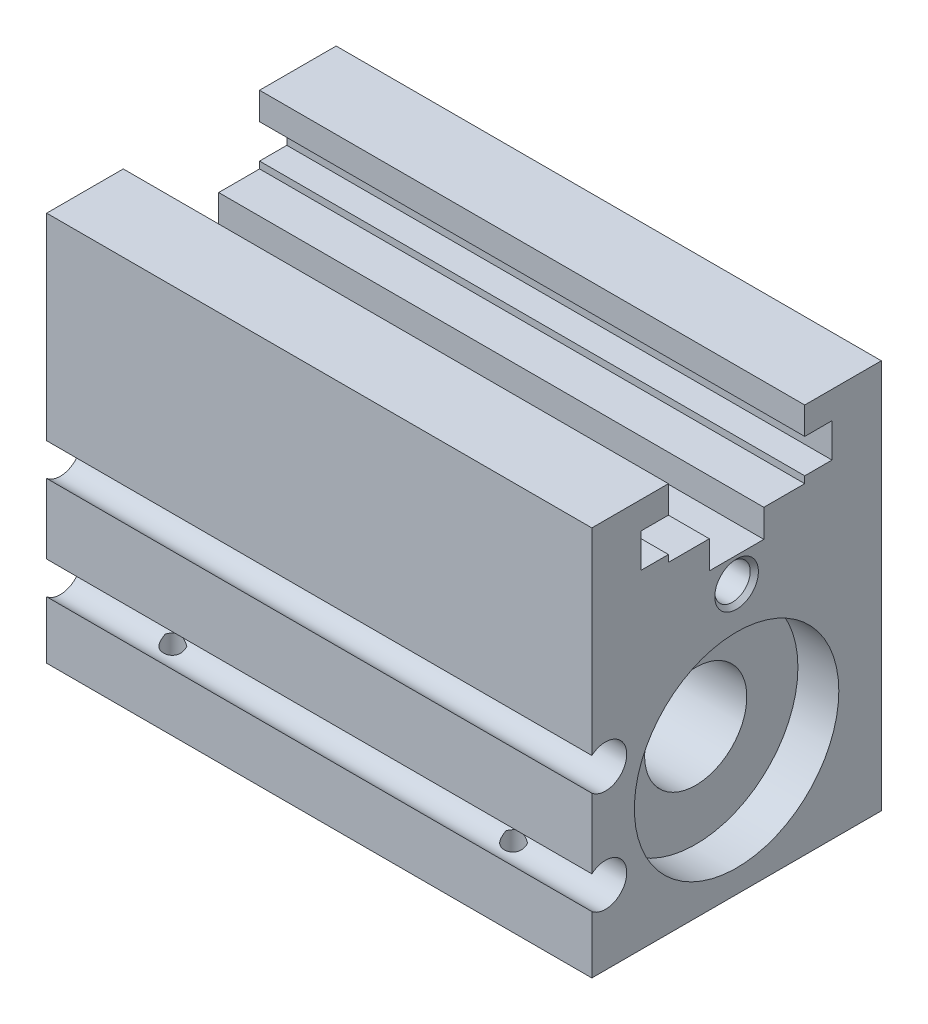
from build123d import *

# Parameters (mm, degrees)
EXTRUDE1_DEPTH     = 50.8
SKETCH2_R          = 9.525
CUT_EXTRUDE1_DEPTH = 3.81
SKETCH3_R          = 1.20269
CUT_EXTRUDE2_DEPTH = 3.048
SKETCH4_R          = 1.20269
CUT_EXTRUDE3_DEPTH = 3.048
CUT_EXTRUDE4_START = 3.81
SKETCH9_R          = 9.525
CUT_EXTRUDE4_DEPTH = 3.81
SKETCH10_W         = 3.81
SKETCH10_H         = 9.3345
SKETCH15_R         = 1.20269
CUT_EXTRUDE5_DEPTH = 3.175
SKETCH16_R         = 1.20269
CUT_EXTRUDE6_DEPTH = 3.175
SKETCH17_R         = 1.20269
CUT_EXTRUDE7_DEPTH = 3.175
SKETCH18_R         = 1.20269
CUT_EXTRUDE8_DEPTH = 3.175
SKETCH20_W         = 40.64
SKETCH20_H         = 4.7625


with BuildPart() as part:
    # Sketch1 → Extrude1 (new body)
    with BuildSketch(Plane(origin=(0, 0, 0), x_dir=(0, 0, -1), z_dir=(1, 0, 0))):
        with BuildLine():
            Line((-13.4874, -18.161), (13.4874, -18.161))
            Line((13.4874, -18.161), (13.4874, 18.161))
            Line((13.4874, 18.161), (6.35, 18.161))
            Line((6.35, 18.161), (6.35, 15.621))
            Line((6.35, 15.621), (8.89, 15.621))
            Line((8.89, 15.621), (8.89, 12.446))
            Line((8.89, 12.446), (6.35, 12.446))
            Line((6.35, 12.446), (6.35, 11.811))
            Line((6.35, 11.811), (2.54, 11.811))
            Line((2.54, 11.811), (2.54, 9.2202))
            Line((2.54, 9.2202), (-2.54, 9.2202))
            Line((-2.54, 9.2202), (-2.54, 11.811))
            Line((-2.54, 11.811), (-6.35, 11.811))
            Line((-6.35, 11.811), (-6.35, 12.446))
            Line((-6.35, 12.446), (-8.89, 12.446))
            Line((-8.89, 12.446), (-8.89, 15.621))
            Line((-8.89, 15.621), (-6.35, 15.621))
            Line((-6.35, 15.621), (-6.35, 18.161))
            Line((-6.35, 18.161), (-13.4874, 18.161))
            Line((-13.4874, 18.161), (-13.4874, -0.206590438))
            ThreePointArc((-13.4874, -0.206590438), (-10.2362, -1.7272), (-13.4874, -3.247809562))
            Line((-13.4874, -3.247809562), (-13.4874, -9.756990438))
            ThreePointArc((-13.4874, -9.756990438), (-10.2362, -11.2776), (-13.4874, -12.798209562))
            Line((-13.4874, -12.798209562), (-13.4874, -18.161))
        make_face()
    extrude(amount=EXTRUDE1_DEPTH)

    # Sketch2 → Cut-Extrude1 (cut)
    with BuildSketch(Plane(origin=(50.8, 0, 0), x_dir=(0, 0, -1), z_dir=(1, 0, 0))):
        with Locations((0, -6.5024)):
            Circle(SKETCH2_R)
    extrude(amount=-CUT_EXTRUDE1_DEPTH, mode=Mode.SUBTRACT)

    # Sketch3 → Cut-Extrude2 (cut)
    with BuildSketch(Plane(origin=(0, 0, 0), x_dir=(0, 0, -1), z_dir=(1, 0, 0))):
        with Locations(Location((10.3251, 8.4582, 0), (0, 0, 180))):
            Circle(SKETCH3_R)
    extrude(amount=CUT_EXTRUDE2_DEPTH, mode=Mode.SUBTRACT)

    # Sketch4 → Cut-Extrude3 (cut)
    with BuildSketch(Plane(origin=(0, 0, 0), x_dir=(0, 0, -1), z_dir=(1, 0, 0))):
        with Locations(Location((-10.3251, -15.367, 0), (0, 0, 180))):
            Circle(SKETCH4_R)
    extrude(amount=CUT_EXTRUDE3_DEPTH, mode=Mode.SUBTRACT)

    # Sketch5 → Cut-Revolve1 (revolve, cut)
    with BuildSketch(Plane.XY.offset(10.3251), mode=Mode.PRIVATE) as cut_revolve1_sk:
        Polygon((0, 8.4582), (0, 9.8552), (0.381, 9.4742), (6.271412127, 9.4742), (6.858, 8.4582), align=None)
    revolve(cut_revolve1_sk.sketch.rotate(Axis((6.858, 8.4582, 10.3251), (-1, 0, 0)), 270), axis=Axis((6.858, 8.4582, 10.3251), (-1, 0, 0)), mode=Mode.SUBTRACT)

    # Sketch6 → Cut-Revolve2 (revolve, cut)
    with BuildSketch(Plane.XY.offset(-10.3251), mode=Mode.PRIVATE) as cut_revolve2_sk:
        Polygon((0, -15.367), (0, -13.97), (0.381, -14.351), (6.271412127, -14.351), (6.858, -15.367), align=None)
    revolve(cut_revolve2_sk.sketch.rotate(Axis((6.858, -15.367, -10.3251), (-1, 0, 0)), 270), axis=Axis((6.858, -15.367, -10.3251), (-1, 0, 0)), mode=Mode.SUBTRACT)

    # Sketch7 → Cut-Revolve3 (revolve, cut)
    with BuildSketch(Plane(origin=(5.715, 0, 0), x_dir=(0, 0, -1), z_dir=(1, 0, 0)), mode=Mode.PRIVATE) as cut_revolve3_sk:
        Polygon((8.9154, 3.8862), (8.9154, 5.8293), (13.0175, 5.8293), (13.4874, 6.2992), (13.4874, 3.8862), align=None)
    revolve(cut_revolve3_sk.sketch.rotate(Axis((5.715, 3.8862, -13.4874), (0, 0, 1)), 270), axis=Axis((5.715, 3.8862, -13.4874), (0, 0, 1)), mode=Mode.SUBTRACT)

    # Sketch8 → Cut-Revolve4 (revolve, cut)
    with BuildSketch(Plane(origin=(43.4975, 0, 0), x_dir=(0, 0, -1), z_dir=(1, 0, 0)), mode=Mode.PRIVATE) as cut_revolve4_sk:
        Polygon((8.9154, 3.8862), (8.9154, 5.8293), (13.0175, 5.8293), (13.4874, 6.2992), (13.4874, 3.8862), align=None)
    revolve(cut_revolve4_sk.sketch.rotate(Axis((43.4975, 3.8862, -13.4874), (0, 0, 1)), 270), axis=Axis((43.4975, 3.8862, -13.4874), (0, 0, 1)), mode=Mode.SUBTRACT)

    # Sketch9 → Cut-Extrude4 (cut)
    with BuildSketch(Plane(origin=(0, 0, 0), x_dir=(0, 0, -1), z_dir=(1, 0, 0)).offset(CUT_EXTRUDE4_START)):
        with Locations((0, -6.5024)):
            Circle(SKETCH9_R)
    extrude(amount=-CUT_EXTRUDE4_DEPTH, mode=Mode.SUBTRACT)

    # Sketch10 → Revolve1 (revolve)
    with BuildSketch(Plane.XY, mode=Mode.PRIVATE) as revolve1_sk:
        with Locations((1.905, -1.83515)):
            Rectangle(SKETCH10_W, SKETCH10_H)
    revolve(revolve1_sk.sketch.rotate(Axis((3.81, -6.5024, 0), (-1, 0, 0)), 270), axis=Axis((3.81, -6.5024, 0), (-1, 0, 0)))

    # Sketch11 → Cut-Revolve5 (revolve, cut)
    with BuildSketch(Plane(origin=(9.525, 0, 0), x_dir=(0, 0, -1), z_dir=(1, 0, 0)), mode=Mode.PRIVATE) as cut_revolve5_sk:
        Polygon((-11.1125, -18.161), (-12.5095, -18.161), (-12.1285, -17.78), (-12.1285, -12.803987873), (-11.1125, -12.2174), align=None)
    revolve(cut_revolve5_sk.sketch.rotate(Axis((9.525, -12.2174, 11.1125), (0, -1, 0)), 180), axis=Axis((9.525, -12.2174, 11.1125), (0, -1, 0)), mode=Mode.SUBTRACT)

    # Sketch12 → Cut-Revolve6 (revolve, cut)
    with BuildSketch(Plane(origin=(41.275, 0, 0), x_dir=(0, 0, -1), z_dir=(1, 0, 0)), mode=Mode.PRIVATE) as cut_revolve6_sk:
        Polygon((-11.1125, -18.161), (-12.5095, -18.161), (-12.1285, -17.78), (-12.1285, -12.803987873), (-11.1125, -12.2174), align=None)
    revolve(cut_revolve6_sk.sketch.rotate(Axis((41.275, -12.2174, 11.1125), (0, -1, 0)), 180), axis=Axis((41.275, -12.2174, 11.1125), (0, -1, 0)), mode=Mode.SUBTRACT)

    # Sketch13 → Cut-Revolve7 (revolve, cut)
    with BuildSketch(Plane(origin=(41.275, 0, 0), x_dir=(0, 0, -1), z_dir=(1, 0, 0)), mode=Mode.PRIVATE) as cut_revolve7_sk:
        Polygon((11.1125, -18.161), (9.7155, -18.161), (10.0965, -17.78), (10.0965, -12.803987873), (11.1125, -12.2174), align=None)
    revolve(cut_revolve7_sk.sketch.rotate(Axis((41.275, -12.2174, -11.1125), (0, -1, 0)), 180), axis=Axis((41.275, -12.2174, -11.1125), (0, -1, 0)), mode=Mode.SUBTRACT)

    # Sketch14 → Cut-Revolve8 (revolve, cut)
    with BuildSketch(Plane(origin=(9.525, 0, 0), x_dir=(0, 0, -1), z_dir=(1, 0, 0)), mode=Mode.PRIVATE) as cut_revolve8_sk:
        Polygon((11.1125, -18.161), (9.7155, -18.161), (10.0965, -17.78), (10.0965, -12.803987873), (11.1125, -12.2174), align=None)
    revolve(cut_revolve8_sk.sketch.rotate(Axis((9.525, -12.2174, -11.1125), (0, -1, 0)), 180), axis=Axis((9.525, -12.2174, -11.1125), (0, -1, 0)), mode=Mode.SUBTRACT)

    # Sketch15 → Cut-Extrude5 (cut)
    with BuildSketch(Plane(origin=(0, -18.161, 0), x_dir=(-1, 0, 0), z_dir=(0, 1, 0))):
        with Locations(Location((-15.875, 11.1125, 0), (0, 0, 90))):
            Circle(SKETCH15_R)
    extrude(amount=CUT_EXTRUDE5_DEPTH, mode=Mode.SUBTRACT)

    # Sketch16 → Cut-Extrude6 (cut)
    with BuildSketch(Plane(origin=(0, -18.161, 0), x_dir=(-1, 0, 0), z_dir=(0, 1, 0))):
        with Locations(Location((-34.925, 11.1125, 0), (0, 0, 90))):
            Circle(SKETCH16_R)
    extrude(amount=CUT_EXTRUDE6_DEPTH, mode=Mode.SUBTRACT)

    # Sketch17 → Cut-Extrude7 (cut)
    with BuildSketch(Plane(origin=(0, -18.161, 0), x_dir=(-1, 0, 0), z_dir=(0, 1, 0))):
        with Locations(Location((-34.925, -11.1125, 0), (0, 0, 90))):
            Circle(SKETCH17_R)
    extrude(amount=CUT_EXTRUDE7_DEPTH, mode=Mode.SUBTRACT)

    # Sketch18 → Cut-Extrude8 (cut)
    with BuildSketch(Plane(origin=(0, -18.161, 0), x_dir=(-1, 0, 0), z_dir=(0, 1, 0))):
        with Locations(Location((-15.875, -11.1125, 0), (0, 0, 90))):
            Circle(SKETCH18_R)
    extrude(amount=CUT_EXTRUDE8_DEPTH, mode=Mode.SUBTRACT)

    # Sketch19 → Cut-Revolve9 (revolve, cut)
    with BuildSketch(Plane.XY, mode=Mode.PRIVATE) as cut_revolve9_sk:
        Polygon((0, 5.360924), (0, 7.392924), (0.381, 7.011924), (3.048, 7.011924), (3.048, 5.360924), align=None)
    revolve(cut_revolve9_sk.sketch.rotate(Axis((3.048, 5.360924, 0), (-1, 0, 0)), 270), axis=Axis((3.048, 5.360924, 0), (-1, 0, 0)), mode=Mode.SUBTRACT)

    # Sketch20 → Cut-Revolve10 (revolve, cut)
    with BuildSketch(Plane.XY, mode=Mode.PRIVATE) as cut_revolve10_sk:
        with Locations((26.67, -4.12115)):
            Rectangle(SKETCH20_W, SKETCH20_H)
    revolve(cut_revolve10_sk.sketch.rotate(Axis((46.99, -6.5024, 0), (-1, 0, 0)), 270), axis=Axis((46.99, -6.5024, 0), (-1, 0, 0)), mode=Mode.SUBTRACT)

    # Sketch21 → Cut-Revolve11 (revolve, cut)
    with BuildSketch(Plane.XY, mode=Mode.PRIVATE) as cut_revolve11_sk:
        Polygon((47.752, 6.8834), (47.752, 8.5344), (50.419, 8.5344), (50.8, 8.9154), (50.8, 6.8834), align=None)
    revolve(cut_revolve11_sk.sketch.rotate(Axis((50.8, 6.8834, 0), (-1, 0, 0)), 270), axis=Axis((50.8, 6.8834, 0), (-1, 0, 0)), mode=Mode.SUBTRACT)


solid = part.part
